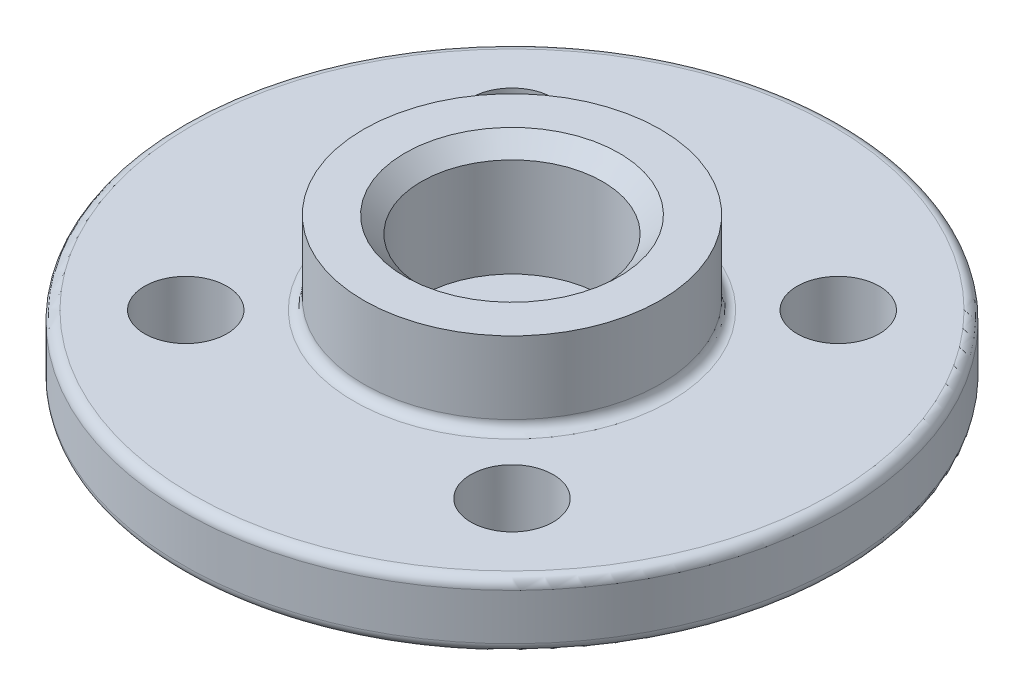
from build123d import *

# Parameters (mm, degrees)
CHAMFER1_SIZE      = 0.5
SKETCH2_R          = 1.25
SKETCH2_R_2        = 1.5
CUT_EXTRUDE1_DEPTH = 15.84082208
CHAMFER2_SIZE      = 0.2
FILLET1_R          = 0.3


with BuildPart() as part:
    # Sketch1 → Revolve1 (revolve)
    with BuildSketch(Plane.XY):
        Polygon((0, 0), (-10, 0), (-10, 2), (-4.5, 2), (-4.5, 4.5), (-2.75, 4.5), (-2.75, 1), (0, 1), align=None)
    revolve(axis=Axis((0, 1, 0), (0, -1, 0)))

    # Chamfer1
    chamfer1_edges = [part.edges().sort_by_distance(p)[0] for p in [
        (2.75, 4.5, 0),
    ]]
    chamfer(chamfer1_edges, length=CHAMFER1_SIZE)

    # Sketch2 → Cut-Extrude1 (cut, through all)
    with BuildSketch(Plane.XZ):
        with Locations((-4.949747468, 4.949747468)):
            Circle(SKETCH2_R)
        with Locations((4.949747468, 4.949747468)):
            Circle(SKETCH2_R)
        with Locations((4.949747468, -4.949747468)):
            Circle(SKETCH2_R)
        with Locations((-4.949747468, -4.949747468)):
            Circle(SKETCH2_R)
        Circle(SKETCH2_R_2)
    extrude(amount=-CUT_EXTRUDE1_DEPTH, mode=Mode.SUBTRACT)

    # Chamfer2
    chamfer2_edges = [part.edges().sort_by_distance(p)[0] for p in [
        (-6.199747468, 0, -4.949747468),
        (3.699747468, 0, -4.949747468),
        (3.699747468, 0, 4.949747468),
        (-6.199747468, 0, 4.949747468),
    ]]
    chamfer(chamfer2_edges, length=CHAMFER2_SIZE)

    # Fillet1
    fillet1_edges = [part.edges().sort_by_distance(p)[0] for p in [
        (4.5, 2, 0),
        (10, 2, 0),
        (10, 0, 0),
    ]]
    fillet(fillet1_edges, radius=FILLET1_R)


solid = part.part
